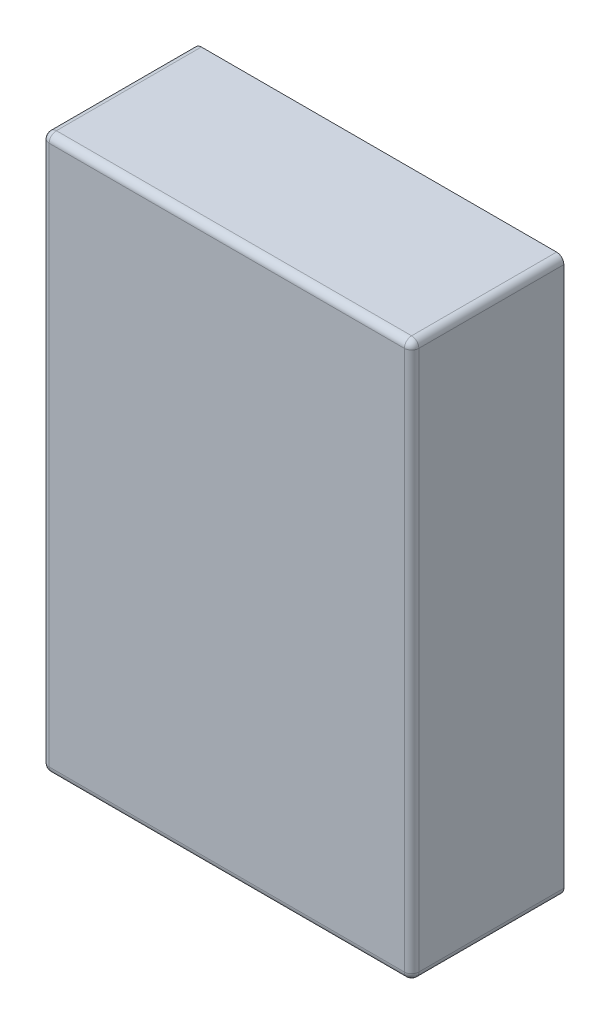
ISO-10303-21;
HEADER;
FILE_DESCRIPTION(('STEP AP214'),'2;1');
FILE_NAME('part.step','',(''),(''),'','','');
FILE_SCHEMA(('AUTOMOTIVE_DESIGN { 1 0 10303 214 1 1 1 1 }'));
ENDSEC;
DATA;
#1=APPLICATION_CONTEXT('core data for automotive mechanical design processes');
#2=APPLICATION_PROTOCOL_DEFINITION('international standard','automotive_design',2000,#1);
#3=PRODUCT_CONTEXT('',#1,'mechanical');
#4=PRODUCT('Part','Part','',(#3));
#5=PRODUCT_RELATED_PRODUCT_CATEGORY('part','',(#4));
#6=PRODUCT_DEFINITION_FORMATION('','',#4);
#7=PRODUCT_DEFINITION_CONTEXT('part definition',#1,'design');
#8=PRODUCT_DEFINITION('design','',#6,#7);
#9=PRODUCT_DEFINITION_SHAPE('','',#8);
#10=(LENGTH_UNIT() NAMED_UNIT(*) SI_UNIT(.MILLI.,.METRE.));
#11=(NAMED_UNIT(*) PLANE_ANGLE_UNIT() SI_UNIT($,.RADIAN.));
#12=(NAMED_UNIT(*) SI_UNIT($,.STERADIAN.) SOLID_ANGLE_UNIT());
#13=UNCERTAINTY_MEASURE_WITH_UNIT(LENGTH_MEASURE(1.E-05),#10,'distance_accuracy_value','');
#14=(GEOMETRIC_REPRESENTATION_CONTEXT(3) GLOBAL_UNCERTAINTY_ASSIGNED_CONTEXT((#13)) GLOBAL_UNIT_ASSIGNED_CONTEXT((#10,
#11,#12)) REPRESENTATION_CONTEXT('',''));
#15=CARTESIAN_POINT('',(0.,0.,0.));
#16=DIRECTION('',(0.,0.,1.));
#17=DIRECTION('',(1.,0.,0.));
#18=AXIS2_PLACEMENT_3D('',#15,#16,#17);
#19=CARTESIAN_POINT('',(9505.591645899,1406.278412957,42.));
#20=DIRECTION('',(0.,0.,1.));
#21=DIRECTION('',(1.,0.,0.));
#22=AXIS2_PLACEMENT_3D('',#19,#20,#21);
#23=PLANE('',#22);
#24=DIRECTION('',(0.,1.,0.));
#25=VECTOR('',#24,1.);
#26=CARTESIAN_POINT('',(9505.59164589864,1480.778412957,42.));
#27=LINE('',#26,#25);
#28=CARTESIAN_POINT('',(9505.59164589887,1555.27841295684,41.9999999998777));
#29=VERTEX_POINT('',#28);
#30=CARTESIAN_POINT('',(9505.59164589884,1406.27841295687,41.9999999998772));
#31=VERTEX_POINT('',#30);
#32=EDGE_CURVE('E403',#29,#31,#27,.F.);
#33=ORIENTED_EDGE('',*,*,#32,.T.);
#34=DIRECTION('',(-1.,0.,0.));
#35=VECTOR('',#34,1.);
#36=CARTESIAN_POINT('',(9554.591645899,1406.27841295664,42.));
#37=LINE('',#36,#35);
#38=CARTESIAN_POINT('',(9603.59164589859,1406.27841295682,42.));
#39=VERTEX_POINT('',#38);
#40=EDGE_CURVE('E290',#31,#39,#37,.F.);
#41=ORIENTED_EDGE('',*,*,#40,.T.);
#42=DIRECTION('',(0.,-1.,0.));
#43=VECTOR('',#42,1.);
#44=CARTESIAN_POINT('',(9603.59164589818,1480.778412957,42.));
#45=LINE('',#44,#43);
#46=CARTESIAN_POINT('',(9603.59164589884,1555.27841295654,41.9999999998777));
#47=VERTEX_POINT('',#46);
#48=EDGE_CURVE('E412',#39,#47,#45,.F.);
#49=ORIENTED_EDGE('',*,*,#48,.T.);
#50=DIRECTION('',(1.,0.,0.));
#51=VECTOR('',#50,1.);
#52=CARTESIAN_POINT('',(9554.591645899,1555.27841295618,42.));
#53=LINE('',#52,#51);
#54=EDGE_CURVE('E334',#47,#29,#53,.F.);
#55=ORIENTED_EDGE('',*,*,#54,.T.);
#56=EDGE_LOOP('',(#33,#41,#49,#55));
#57=FACE_BOUND('',#56,.T.);
#58=ADVANCED_FACE('F17',(#57),#23,.T.);
#59=CARTESIAN_POINT('',(9505.59164589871,1555.2784129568,39.9999999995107));
#60=DIRECTION('',(0.,-1.,0.));
#61=DIRECTION('',(0.,0.,-1.));
#62=AXIS2_PLACEMENT_3D('',#59,#60,#61);
#63=CIRCLE('',#62,0.5);
#64=TRIMMED_CURVE('',#63,(PARAMETER_VALUE(5.71986902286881E-10)),
(PARAMETER_VALUE(3.14159265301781)),.T.,.PARAMETER.);
#65=CARTESIAN_POINT('',(9505.591645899,1555.278412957,40.));
#66=DIRECTION('',(0.,0.,1.));
#67=AXIS1_PLACEMENT('',#65,#66);
#68=SURFACE_OF_REVOLUTION('',#64,#67);
#69=CARTESIAN_POINT('',(9505.591645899,1555.278412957,40.));
#70=DIRECTION('',(1.,0.,0.));
#71=DIRECTION('',(0.,0.,-1.));
#72=AXIS2_PLACEMENT_3D('',#69,#70,#71);
#73=CIRCLE('',#72,0.5);
#74=CARTESIAN_POINT('',(9505.59164589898,1555.2784129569,40.5));
#75=VERTEX_POINT('',#74);
#76=CARTESIAN_POINT('',(9505.591645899,1555.778412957,40.0000000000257));
#77=VERTEX_POINT('',#76);
#78=EDGE_CURVE('E71',#75,#77,#73,.F.);
#79=ORIENTED_EDGE('',*,*,#78,.F.);
#80=CARTESIAN_POINT('',(9505.591645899,1555.278412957,40.));
#81=DIRECTION('',(0.,1.,0.));
#82=DIRECTION('',(0.,0.,1.));
#83=AXIS2_PLACEMENT_3D('',#80,#81,#82);
#84=CIRCLE('',#83,0.5);
#85=CARTESIAN_POINT('',(9505.091645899,1555.278412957,40.));
#86=VERTEX_POINT('',#85);
#87=EDGE_CURVE('E263',#86,#75,#84,.T.);
#88=ORIENTED_EDGE('',*,*,#87,.F.);
#89=CARTESIAN_POINT('',(9505.591645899,1555.278412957,40.));
#90=DIRECTION('',(0.,0.,-1.));
#91=DIRECTION('',(-1.,0.,0.));
#92=AXIS2_PLACEMENT_3D('',#89,#90,#91);
#93=CIRCLE('',#92,0.499999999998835);
#94=EDGE_CURVE('E70',#77,#86,#93,.F.);
#95=ORIENTED_EDGE('',*,*,#94,.F.);
#96=EDGE_LOOP('',(#79,#88,#95));
#97=FACE_BOUND('',#96,.T.);
#98=ADVANCED_FACE('F379',(#97),#68,.F.);
#99=CARTESIAN_POINT('',(9603.59164589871,1555.2784129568,39.9999999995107));
#100=DIRECTION('',(0.,-1.,0.));
#101=DIRECTION('',(0.,0.,-1.));
#102=AXIS2_PLACEMENT_3D('',#99,#100,#101);
#103=CIRCLE('',#102,0.5);
#104=TRIMMED_CURVE('',#103,(PARAMETER_VALUE(5.75539615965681E-10)),
(PARAMETER_VALUE(3.14159265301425)),.T.,.PARAMETER.);
#105=CARTESIAN_POINT('',(9603.591645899,1555.278412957,40.));
#106=DIRECTION('',(0.,0.,1.));
#107=AXIS1_PLACEMENT('',#105,#106);
#108=SURFACE_OF_REVOLUTION('',#104,#107);
#109=CARTESIAN_POINT('',(9603.591645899,1555.278412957,40.));
#110=DIRECTION('',(1.,0.,0.));
#111=DIRECTION('',(0.,0.,-1.));
#112=AXIS2_PLACEMENT_3D('',#109,#110,#111);
#113=CIRCLE('',#112,0.5);
#114=CARTESIAN_POINT('',(9603.59164589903,1555.778412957,40.));
#115=VERTEX_POINT('',#114);
#116=CARTESIAN_POINT('',(9603.5916458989,1555.27841295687,40.5));
#117=VERTEX_POINT('',#116);
#118=EDGE_CURVE('E250',#115,#117,#113,.T.);
#119=ORIENTED_EDGE('',*,*,#118,.F.);
#120=CARTESIAN_POINT('',(9603.591645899,1555.278412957,40.));
#121=DIRECTION('',(0.,0.,-1.));
#122=DIRECTION('',(-1.,0.,0.));
#123=AXIS2_PLACEMENT_3D('',#120,#121,#122);
#124=CIRCLE('',#123,0.500000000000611);
#125=CARTESIAN_POINT('',(9604.091645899,1555.278412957,40.0000000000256));
#126=VERTEX_POINT('',#125);
#127=EDGE_CURVE('E212',#126,#115,#124,.F.);
#128=ORIENTED_EDGE('',*,*,#127,.F.);
#129=CARTESIAN_POINT('',(9603.591645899,1555.278412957,40.));
#130=DIRECTION('',(0.,-1.,0.));
#131=DIRECTION('',(0.,0.,-1.));
#132=AXIS2_PLACEMENT_3D('',#129,#130,#131);
#133=CIRCLE('',#132,0.5);
#134=EDGE_CURVE('E234',#117,#126,#133,.F.);
#135=ORIENTED_EDGE('',*,*,#134,.F.);
#136=EDGE_LOOP('',(#119,#128,#135));
#137=FACE_BOUND('',#136,.T.);
#138=ADVANCED_FACE('F375',(#137),#108,.F.);
#139=CARTESIAN_POINT('',(9505.591645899,1406.278412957,40.5));
#140=DIRECTION('',(0.,0.,1.));
#141=DIRECTION('',(1.,0.,0.));
#142=AXIS2_PLACEMENT_3D('',#139,#140,#141);
#143=PLANE('',#142);
#144=DIRECTION('',(-1.,0.,0.));
#145=VECTOR('',#144,1.);
#146=CARTESIAN_POINT('',(9554.591645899,1406.27841295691,40.5));
#147=LINE('',#146,#145);
#148=CARTESIAN_POINT('',(9505.59164589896,1406.27841295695,40.5));
#149=VERTEX_POINT('',#148);
#150=CARTESIAN_POINT('',(9603.59164589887,1406.27841295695,40.5));
#151=VERTEX_POINT('',#150);
#152=EDGE_CURVE('E211',#149,#151,#147,.F.);
#153=ORIENTED_EDGE('',*,*,#152,.F.);
#154=DIRECTION('',(0.,1.,0.));
#155=VECTOR('',#154,1.);
#156=CARTESIAN_POINT('',(9505.59164589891,1480.778412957,40.5));
#157=LINE('',#156,#155);
#158=EDGE_CURVE('E253',#75,#149,#157,.F.);
#159=ORIENTED_EDGE('',*,*,#158,.F.);
#160=DIRECTION('',(1.,0.,0.));
#161=VECTOR('',#160,1.);
#162=CARTESIAN_POINT('',(9554.591645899,1555.27841295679,40.5));
#163=LINE('',#162,#161);
#164=EDGE_CURVE('E247',#117,#75,#163,.F.);
#165=ORIENTED_EDGE('',*,*,#164,.F.);
#166=DIRECTION('',(0.,-1.,0.));
#167=VECTOR('',#166,1.);
#168=CARTESIAN_POINT('',(9603.5916458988,1480.778412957,40.5));
#169=LINE('',#168,#167);
#170=EDGE_CURVE('E231',#151,#117,#169,.F.);
#171=ORIENTED_EDGE('',*,*,#170,.F.);
#172=EDGE_LOOP('',(#153,#159,#165,#171));
#173=FACE_BOUND('',#172,.T.);
#174=ADVANCED_FACE('F373',(#173),#143,.F.);
#175=CARTESIAN_POINT('',(9603.59164589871,1406.2784129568,39.9999999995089));
#176=DIRECTION('',(0.,-1.,0.));
#177=DIRECTION('',(0.,0.,-1.));
#178=AXIS2_PLACEMENT_3D('',#175,#176,#177);
#179=CIRCLE('',#178,0.5);
#180=TRIMMED_CURVE('',#179,(PARAMETER_VALUE(5.75539615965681E-10)),
(PARAMETER_VALUE(3.14159265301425)),.T.,.PARAMETER.);
#181=CARTESIAN_POINT('',(9603.591645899,1406.278412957,40.));
#182=DIRECTION('',(0.,0.,1.));
#183=AXIS1_PLACEMENT('',#181,#182);
#184=SURFACE_OF_REVOLUTION('',#180,#183);
#185=CARTESIAN_POINT('',(9603.591645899,1406.278412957,40.));
#186=DIRECTION('',(0.,-1.,0.));
#187=DIRECTION('',(0.,0.,-1.));
#188=AXIS2_PLACEMENT_3D('',#185,#186,#187);
#189=CIRCLE('',#188,0.5);
#190=CARTESIAN_POINT('',(9604.091645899,1406.27841295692,40.0000000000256));
#191=VERTEX_POINT('',#190);
#192=EDGE_CURVE('E228',#191,#151,#189,.T.);
#193=ORIENTED_EDGE('',*,*,#192,.F.);
#194=CARTESIAN_POINT('',(9603.591645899,1406.278412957,40.));
#195=DIRECTION('',(0.,0.,-1.));
#196=DIRECTION('',(-1.,0.,0.));
#197=AXIS2_PLACEMENT_3D('',#194,#195,#196);
#198=CIRCLE('',#197,0.500000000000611);
#199=CARTESIAN_POINT('',(9603.591645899,1405.778412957,39.9999999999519));
#200=VERTEX_POINT('',#199);
#201=EDGE_CURVE('E202',#200,#191,#198,.F.);
#202=ORIENTED_EDGE('',*,*,#201,.F.);
#203=CARTESIAN_POINT('',(9603.591645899,1406.278412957,40.));
#204=DIRECTION('',(-1.,0.,0.));
#205=DIRECTION('',(0.,0.,1.));
#206=AXIS2_PLACEMENT_3D('',#203,#204,#205);
#207=CIRCLE('',#206,0.5);
#208=EDGE_CURVE('E215',#151,#200,#207,.F.);
#209=ORIENTED_EDGE('',*,*,#208,.F.);
#210=EDGE_LOOP('',(#193,#202,#209));
#211=FACE_BOUND('',#210,.T.);
#212=ADVANCED_FACE('F370',(#211),#184,.F.);
#213=CARTESIAN_POINT('',(9505.59164589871,1406.2784129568,39.9999999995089));
#214=DIRECTION('',(0.,-1.,0.));
#215=DIRECTION('',(0.,0.,-1.));
#216=AXIS2_PLACEMENT_3D('',#213,#214,#215);
#217=CIRCLE('',#216,0.5);
#218=TRIMMED_CURVE('',#217,(PARAMETER_VALUE(5.71986902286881E-10)),
(PARAMETER_VALUE(3.14159265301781)),.T.,.PARAMETER.);
#219=CARTESIAN_POINT('',(9505.591645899,1406.278412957,40.));
#220=DIRECTION('',(0.,0.,1.));
#221=AXIS1_PLACEMENT('',#219,#220);
#222=SURFACE_OF_REVOLUTION('',#218,#221);
#223=CARTESIAN_POINT('',(9505.591645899,1406.278412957,40.));
#224=DIRECTION('',(0.,1.,0.));
#225=DIRECTION('',(0.,0.,1.));
#226=AXIS2_PLACEMENT_3D('',#223,#224,#225);
#227=CIRCLE('',#226,0.5);
#228=CARTESIAN_POINT('',(9505.091645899,1406.27841295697,39.9999999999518));
#229=VERTEX_POINT('',#228);
#230=EDGE_CURVE('E260',#149,#229,#227,.F.);
#231=ORIENTED_EDGE('',*,*,#230,.F.);
#232=CARTESIAN_POINT('',(9505.591645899,1406.278412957,40.));
#233=DIRECTION('',(-1.,0.,0.));
#234=DIRECTION('',(0.,0.,1.));
#235=AXIS2_PLACEMENT_3D('',#232,#233,#234);
#236=CIRCLE('',#235,0.5);
#237=CARTESIAN_POINT('',(9505.591645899,1405.778412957,39.9999999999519));
#238=VERTEX_POINT('',#237);
#239=EDGE_CURVE('E208',#238,#149,#236,.T.);
#240=ORIENTED_EDGE('',*,*,#239,.F.);
#241=CARTESIAN_POINT('',(9505.591645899,1406.278412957,40.));
#242=DIRECTION('',(0.,0.,-1.));
#243=DIRECTION('',(-1.,0.,0.));
#244=AXIS2_PLACEMENT_3D('',#241,#242,#243);
#245=CIRCLE('',#244,0.499999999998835);
#246=EDGE_CURVE('E193',#229,#238,#245,.F.);
#247=ORIENTED_EDGE('',*,*,#246,.F.);
#248=EDGE_LOOP('',(#231,#240,#247));
#249=FACE_BOUND('',#248,.T.);
#250=ADVANCED_FACE('F357',(#249),#222,.F.);
#251=CARTESIAN_POINT('',(9603.59164589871,1406.2784129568,39.9999999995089));
#252=DIRECTION('',(0.,0.,1.));
#253=DIRECTION('',(-1.,0.,0.));
#254=AXIS2_PLACEMENT_3D('',#251,#252,#253);
#255=SPHERICAL_SURFACE('',#254,2.);
#256=CARTESIAN_POINT('',(9603.591645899,1406.278412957,40.));
#257=DIRECTION('',(0.,0.,-1.));
#258=DIRECTION('',(-1.,0.,0.));
#259=AXIS2_PLACEMENT_3D('',#256,#257,#258);
#260=CIRCLE('',#259,2.00000000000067);
#261=CARTESIAN_POINT('',(9603.591645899,1404.278412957,40.));
#262=VERTEX_POINT('',#261);
#263=CARTESIAN_POINT('',(9605.591645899,1406.27841295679,40.));
#264=VERTEX_POINT('',#263);
#265=EDGE_CURVE('E190',#262,#264,#260,.F.);
#266=ORIENTED_EDGE('',*,*,#265,.T.);
#267=CARTESIAN_POINT('',(9603.591645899,1406.278412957,40.));
#268=DIRECTION('',(0.,-1.,0.));
#269=DIRECTION('',(0.,0.,-1.));
#270=AXIS2_PLACEMENT_3D('',#267,#268,#269);
#271=CIRCLE('',#270,2.);
#272=EDGE_CURVE('E415',#264,#39,#271,.T.);
#273=ORIENTED_EDGE('',*,*,#272,.T.);
#274=CARTESIAN_POINT('',(9603.591645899,1406.278412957,40.));
#275=DIRECTION('',(-1.,0.,0.));
#276=DIRECTION('',(0.,0.,1.));
#277=AXIS2_PLACEMENT_3D('',#274,#275,#276);
#278=CIRCLE('',#277,2.);
#279=EDGE_CURVE('E281',#39,#262,#278,.F.);
#280=ORIENTED_EDGE('',*,*,#279,.T.);
#281=EDGE_LOOP('',(#266,#273,#280));
#282=FACE_BOUND('',#281,.T.);
#283=ADVANCED_FACE('F352',(#282),#255,.T.);
#284=CARTESIAN_POINT('',(9603.591645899,1555.278412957,40.));
#285=DIRECTION('',(0.,-1.,0.));
#286=DIRECTION('',(1.,0.,0.));
#287=AXIS2_PLACEMENT_3D('',#284,#285,#286);
#288=CYLINDRICAL_SURFACE('',#287,2.);
#289=DIRECTION('',(0.,1.,0.));
#290=VECTOR('',#289,1.);
#291=CARTESIAN_POINT('',(9605.591645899,1480.778412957,40.));
#292=LINE('',#291,#290);
#293=CARTESIAN_POINT('',(9605.59164589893,1555.27841295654,40.));
#294=VERTEX_POINT('',#293);
#295=EDGE_CURVE('E184',#264,#294,#292,.T.);
#296=ORIENTED_EDGE('',*,*,#295,.T.);
#297=CARTESIAN_POINT('',(9603.59164589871,1555.2784129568,39.9999999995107));
#298=DIRECTION('',(0.,-1.,0.));
#299=DIRECTION('',(8.88178419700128E-13,0.,-1.));
#300=AXIS2_PLACEMENT_3D('',#297,#298,#299);
#301=CIRCLE('',#300,2.);
#302=EDGE_CURVE('E343',#294,#47,#301,.T.);
#303=ORIENTED_EDGE('',*,*,#302,.T.);
#304=ORIENTED_EDGE('',*,*,#48,.F.);
#305=ORIENTED_EDGE('',*,*,#272,.F.);
#306=EDGE_LOOP('',(#296,#303,#304,#305));
#307=FACE_BOUND('',#306,.T.);
#308=ADVANCED_FACE('F348',(#307),#288,.T.);
#309=CARTESIAN_POINT('',(9603.59164589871,1555.2784129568,39.9999999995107));
#310=DIRECTION('',(0.,0.,1.));
#311=DIRECTION('',(-1.,0.,0.));
#312=AXIS2_PLACEMENT_3D('',#309,#310,#311);
#313=SPHERICAL_SURFACE('',#312,2.);
#314=CARTESIAN_POINT('',(9603.591645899,1555.278412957,40.));
#315=DIRECTION('',(0.,0.,-1.));
#316=DIRECTION('',(-1.,0.,0.));
#317=AXIS2_PLACEMENT_3D('',#314,#315,#316);
#318=CIRCLE('',#317,2.00000000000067);
#319=CARTESIAN_POINT('',(9603.59164589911,1557.278412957,40.));
#320=VERTEX_POINT('',#319);
#321=EDGE_CURVE('E178',#294,#320,#318,.F.);
#322=ORIENTED_EDGE('',*,*,#321,.T.);
#323=CARTESIAN_POINT('',(9603.591645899,1555.278412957,40.));
#324=DIRECTION('',(1.,0.,0.));
#325=DIRECTION('',(0.,0.,-1.));
#326=AXIS2_PLACEMENT_3D('',#323,#324,#325);
#327=CIRCLE('',#326,2.);
#328=EDGE_CURVE('E325',#320,#47,#327,.T.);
#329=ORIENTED_EDGE('',*,*,#328,.T.);
#330=ORIENTED_EDGE('',*,*,#302,.F.);
#331=EDGE_LOOP('',(#322,#329,#330));
#332=FACE_BOUND('',#331,.T.);
#333=ADVANCED_FACE('F345',(#332),#313,.T.);
#334=CARTESIAN_POINT('',(9505.591645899,1555.278412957,40.));
#335=DIRECTION('',(1.,4.44089209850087E-13,0.));
#336=DIRECTION('',(-4.44089209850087E-13,1.,0.));
#337=AXIS2_PLACEMENT_3D('',#334,#335,#336);
#338=CYLINDRICAL_SURFACE('',#337,2.);
#339=DIRECTION('',(-1.,0.,0.));
#340=VECTOR('',#339,1.);
#341=CARTESIAN_POINT('',(9554.591645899,1557.278412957,40.));
#342=LINE('',#341,#340);
#343=CARTESIAN_POINT('',(9505.59164589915,1557.27841295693,40.));
#344=VERTEX_POINT('',#343);
#345=EDGE_CURVE('E172',#320,#344,#342,.T.);
#346=ORIENTED_EDGE('',*,*,#345,.T.);
#347=CARTESIAN_POINT('',(9505.5916458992,1555.27841295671,39.9999999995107));
#348=DIRECTION('',(1.,2.05103206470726E-10,0.));
#349=DIRECTION('',(0.,0.,-1.));
#350=AXIS2_PLACEMENT_3D('',#347,#348,#349);
#351=CIRCLE('',#350,2.);
#352=EDGE_CURVE('E321',#344,#29,#351,.T.);
#353=ORIENTED_EDGE('',*,*,#352,.T.);
#354=ORIENTED_EDGE('',*,*,#54,.F.);
#355=ORIENTED_EDGE('',*,*,#328,.F.);
#356=EDGE_LOOP('',(#346,#353,#354,#355));
#357=FACE_BOUND('',#356,.T.);
#358=ADVANCED_FACE('F313',(#357),#338,.T.);
#359=CARTESIAN_POINT('',(9505.59164589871,1555.2784129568,39.9999999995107));
#360=DIRECTION('',(0.,0.,1.));
#361=DIRECTION('',(-1.,0.,0.));
#362=AXIS2_PLACEMENT_3D('',#359,#360,#361);
#363=SPHERICAL_SURFACE('',#362,2.);
#364=CARTESIAN_POINT('',(9505.591645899,1555.278412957,40.));
#365=DIRECTION('',(0.,1.,0.));
#366=DIRECTION('',(0.,0.,1.));
#367=AXIS2_PLACEMENT_3D('',#364,#365,#366);
#368=CIRCLE('',#367,2.);
#369=CARTESIAN_POINT('',(9503.591645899,1555.278412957,40.));
#370=VERTEX_POINT('',#369);
#371=EDGE_CURVE('E324',#370,#29,#368,.T.);
#372=ORIENTED_EDGE('',*,*,#371,.T.);
#373=ORIENTED_EDGE('',*,*,#352,.F.);
#374=CARTESIAN_POINT('',(9505.591645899,1555.278412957,40.));
#375=DIRECTION('',(0.,0.,-1.));
#376=DIRECTION('',(-1.,0.,0.));
#377=AXIS2_PLACEMENT_3D('',#374,#375,#376);
#378=CIRCLE('',#377,1.99999999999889);
#379=EDGE_CURVE('E166',#344,#370,#378,.F.);
#380=ORIENTED_EDGE('',*,*,#379,.T.);
#381=EDGE_LOOP('',(#372,#373,#380));
#382=FACE_BOUND('',#381,.T.);
#383=ADVANCED_FACE('F308',(#382),#363,.T.);
#384=CARTESIAN_POINT('',(9505.591645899,1406.278412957,40.));
#385=DIRECTION('',(0.,1.,0.));
#386=DIRECTION('',(0.,0.,1.));
#387=AXIS2_PLACEMENT_3D('',#384,#385,#386);
#388=CYLINDRICAL_SURFACE('',#387,2.);
#389=ORIENTED_EDGE('',*,*,#32,.F.);
#390=ORIENTED_EDGE('',*,*,#371,.F.);
#391=DIRECTION('',(0.,-1.,0.));
#392=VECTOR('',#391,1.);
#393=CARTESIAN_POINT('',(9503.591645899,1480.778412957,40.));
#394=LINE('',#393,#392);
#395=CARTESIAN_POINT('',(9503.59164589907,1406.27841295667,40.));
#396=VERTEX_POINT('',#395);
#397=EDGE_CURVE('E160',#370,#396,#394,.T.);
#398=ORIENTED_EDGE('',*,*,#397,.T.);
#399=CARTESIAN_POINT('',(9505.59164589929,1406.2784129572,39.9999999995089));
#400=DIRECTION('',(-4.10206857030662E-10,1.,0.));
#401=DIRECTION('',(0.,0.,-1.));
#402=AXIS2_PLACEMENT_3D('',#399,#400,#401);
#403=CIRCLE('',#402,2.);
#404=EDGE_CURVE('E295',#396,#31,#403,.T.);
#405=ORIENTED_EDGE('',*,*,#404,.T.);
#406=EDGE_LOOP('',(#389,#390,#398,#405));
#407=FACE_BOUND('',#406,.T.);
#408=ADVANCED_FACE('F303',(#407),#388,.T.);
#409=CARTESIAN_POINT('',(9505.59164589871,1406.2784129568,39.9999999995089));
#410=DIRECTION('',(0.,0.,1.));
#411=DIRECTION('',(-1.,0.,0.));
#412=AXIS2_PLACEMENT_3D('',#409,#410,#411);
#413=SPHERICAL_SURFACE('',#412,2.);
#414=CARTESIAN_POINT('',(9505.591645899,1406.278412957,40.));
#415=DIRECTION('',(-1.,0.,0.));
#416=DIRECTION('',(0.,0.,1.));
#417=AXIS2_PLACEMENT_3D('',#414,#415,#416);
#418=CIRCLE('',#417,2.);
#419=CARTESIAN_POINT('',(9505.591645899,1404.278412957,40.));
#420=VERTEX_POINT('',#419);
#421=EDGE_CURVE('E264',#420,#31,#418,.T.);
#422=ORIENTED_EDGE('',*,*,#421,.T.);
#423=ORIENTED_EDGE('',*,*,#404,.F.);
#424=CARTESIAN_POINT('',(9505.591645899,1406.278412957,40.));
#425=DIRECTION('',(0.,0.,-1.));
#426=DIRECTION('',(-1.,0.,0.));
#427=AXIS2_PLACEMENT_3D('',#424,#425,#426);
#428=CIRCLE('',#427,1.99999999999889);
#429=EDGE_CURVE('E154',#396,#420,#428,.F.);
#430=ORIENTED_EDGE('',*,*,#429,.T.);
#431=EDGE_LOOP('',(#422,#423,#430));
#432=FACE_BOUND('',#431,.T.);
#433=ADVANCED_FACE('F298',(#432),#413,.T.);
#434=CARTESIAN_POINT('',(9603.591645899,1406.278412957,40.));
#435=DIRECTION('',(-1.,0.,0.));
#436=DIRECTION('',(0.,0.,1.));
#437=AXIS2_PLACEMENT_3D('',#434,#435,#436);
#438=CYLINDRICAL_SURFACE('',#437,2.);
#439=DIRECTION('',(1.,0.,0.));
#440=VECTOR('',#439,1.);
#441=CARTESIAN_POINT('',(9554.591645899,1404.278412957,40.));
#442=LINE('',#441,#440);
#443=EDGE_CURVE('E143',#420,#262,#442,.T.);
#444=ORIENTED_EDGE('',*,*,#443,.T.);
#445=ORIENTED_EDGE('',*,*,#279,.F.);
#446=ORIENTED_EDGE('',*,*,#40,.F.);
#447=ORIENTED_EDGE('',*,*,#421,.F.);
#448=EDGE_LOOP('',(#444,#445,#446,#447));
#449=FACE_BOUND('',#448,.T.);
#450=ADVANCED_FACE('F302',(#449),#438,.T.);
#451=CARTESIAN_POINT('',(9505.591645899,1406.278412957,40.));
#452=DIRECTION('',(0.,1.,0.));
#453=DIRECTION('',(0.,0.,1.));
#454=AXIS2_PLACEMENT_3D('',#451,#452,#453);
#455=CYLINDRICAL_SURFACE('',#454,0.5);
#456=ORIENTED_EDGE('',*,*,#87,.T.);
#457=ORIENTED_EDGE('',*,*,#158,.T.);
#458=ORIENTED_EDGE('',*,*,#230,.T.);
#459=DIRECTION('',(0.,-1.,0.));
#460=VECTOR('',#459,1.);
#461=CARTESIAN_POINT('',(9505.091645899,1480.778412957,40.));
#462=LINE('',#461,#460);
#463=EDGE_CURVE('E139',#86,#229,#462,.T.);
#464=ORIENTED_EDGE('',*,*,#463,.F.);
#465=EDGE_LOOP('',(#456,#457,#458,#464));
#466=FACE_BOUND('',#465,.T.);
#467=ADVANCED_FACE('F657',(#466),#455,.F.);
#468=CARTESIAN_POINT('',(9505.591645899,1555.278412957,40.));
#469=DIRECTION('',(1.,1.77635683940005E-12,0.));
#470=DIRECTION('',(-1.77635683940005E-12,1.,0.));
#471=AXIS2_PLACEMENT_3D('',#468,#469,#470);
#472=CYLINDRICAL_SURFACE('',#471,0.5);
#473=ORIENTED_EDGE('',*,*,#78,.T.);
#474=DIRECTION('',(-1.,0.,0.));
#475=VECTOR('',#474,1.);
#476=CARTESIAN_POINT('',(9554.591645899,1555.778412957,40.));
#477=LINE('',#476,#475);
#478=EDGE_CURVE('E79',#115,#77,#477,.T.);
#479=ORIENTED_EDGE('',*,*,#478,.F.);
#480=ORIENTED_EDGE('',*,*,#118,.T.);
#481=ORIENTED_EDGE('',*,*,#164,.T.);
#482=EDGE_LOOP('',(#473,#479,#480,#481));
#483=FACE_BOUND('',#482,.T.);
#484=ADVANCED_FACE('F663',(#483),#472,.F.);
#485=CARTESIAN_POINT('',(9505.591645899,1555.278412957,40.));
#486=DIRECTION('',(0.,0.,-1.));
#487=DIRECTION('',(0.,1.,0.));
#488=AXIS2_PLACEMENT_3D('',#485,#486,#487);
#489=CYLINDRICAL_SURFACE('',#488,0.499999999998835);
#490=ORIENTED_EDGE('',*,*,#94,.T.);
#491=DIRECTION('',(0.,0.,1.));
#492=VECTOR('',#491,1.);
#493=CARTESIAN_POINT('',(9505.091645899,1555.278412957,20.));
#494=LINE('',#493,#492);
#495=CARTESIAN_POINT('',(9505.091645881,1555.278412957,0.));
#496=VERTEX_POINT('',#495);
#497=EDGE_CURVE('E68',#496,#86,#494,.T.);
#498=ORIENTED_EDGE('',*,*,#497,.F.);
#499=CARTESIAN_POINT('',(9505.591645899,1555.278412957,0.));
#500=DIRECTION('',(0.,0.,-1.));
#501=DIRECTION('',(0.,1.,0.));
#502=AXIS2_PLACEMENT_3D('',#499,#500,#501);
#503=CIRCLE('',#502,0.499999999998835);
#504=CARTESIAN_POINT('',(9505.591645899,1555.778412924,0.));
#505=VERTEX_POINT('',#504);
#506=EDGE_CURVE('E21',#496,#505,#503,.T.);
#507=ORIENTED_EDGE('',*,*,#506,.T.);
#508=DIRECTION('',(0.,0.,-1.));
#509=VECTOR('',#508,1.);
#510=CARTESIAN_POINT('',(9505.591645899,1555.778412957,20.));
#511=LINE('',#510,#509);
#512=EDGE_CURVE('E66',#77,#505,#511,.T.);
#513=ORIENTED_EDGE('',*,*,#512,.F.);
#514=EDGE_LOOP('',(#490,#498,#507,#513));
#515=FACE_BOUND('',#514,.T.);
#516=ADVANCED_FACE('F64',(#515),#489,.F.);
#517=CARTESIAN_POINT('',(9603.591645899,1555.278412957,40.));
#518=DIRECTION('',(-2.22044604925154E-13,-1.,0.));
#519=DIRECTION('',(1.,-2.22044604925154E-13,0.));
#520=AXIS2_PLACEMENT_3D('',#517,#518,#519);
#521=CYLINDRICAL_SURFACE('',#520,0.5);
#522=ORIENTED_EDGE('',*,*,#134,.T.);
#523=DIRECTION('',(0.,1.,0.));
#524=VECTOR('',#523,1.);
#525=CARTESIAN_POINT('',(9604.091645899,1480.778412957,40.));
#526=LINE('',#525,#524);
#527=EDGE_CURVE('E81',#191,#126,#526,.T.);
#528=ORIENTED_EDGE('',*,*,#527,.F.);
#529=ORIENTED_EDGE('',*,*,#192,.T.);
#530=ORIENTED_EDGE('',*,*,#170,.T.);
#531=EDGE_LOOP('',(#522,#528,#529,#530));
#532=FACE_BOUND('',#531,.T.);
#533=ADVANCED_FACE('F444',(#532),#521,.F.);
#534=CARTESIAN_POINT('',(9603.591645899,1555.278412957,40.));
#535=DIRECTION('',(0.,0.,-1.));
#536=DIRECTION('',(0.,1.,0.));
#537=AXIS2_PLACEMENT_3D('',#534,#535,#536);
#538=CYLINDRICAL_SURFACE('',#537,0.500000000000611);
#539=ORIENTED_EDGE('',*,*,#127,.T.);
#540=DIRECTION('',(0.,0.,1.));
#541=VECTOR('',#540,1.);
#542=CARTESIAN_POINT('',(9603.591645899,1555.778412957,20.));
#543=LINE('',#542,#541);
#544=CARTESIAN_POINT('',(9603.591645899,1555.778412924,0.));
#545=VERTEX_POINT('',#544);
#546=EDGE_CURVE('E132',#545,#115,#543,.T.);
#547=ORIENTED_EDGE('',*,*,#546,.F.);
#548=CARTESIAN_POINT('',(9603.591645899,1555.278412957,0.));
#549=DIRECTION('',(0.,0.,-1.));
#550=DIRECTION('',(0.,1.,0.));
#551=AXIS2_PLACEMENT_3D('',#548,#549,#550);
#552=CIRCLE('',#551,0.500000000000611);
#553=CARTESIAN_POINT('',(9604.091645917,1555.278412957,0.));
#554=VERTEX_POINT('',#553);
#555=EDGE_CURVE('E85',#545,#554,#552,.T.);
#556=ORIENTED_EDGE('',*,*,#555,.T.);
#557=DIRECTION('',(0.,0.,-1.));
#558=VECTOR('',#557,1.);
#559=CARTESIAN_POINT('',(9604.091645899,1555.278412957,20.));
#560=LINE('',#559,#558);
#561=EDGE_CURVE('E120',#126,#554,#560,.T.);
#562=ORIENTED_EDGE('',*,*,#561,.F.);
#563=EDGE_LOOP('',(#539,#547,#556,#562));
#564=FACE_BOUND('',#563,.T.);
#565=ADVANCED_FACE('F429',(#564),#538,.F.);
#566=CARTESIAN_POINT('',(9603.591645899,1406.278412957,40.));
#567=DIRECTION('',(-1.,0.,0.));
#568=DIRECTION('',(0.,0.,1.));
#569=AXIS2_PLACEMENT_3D('',#566,#567,#568);
#570=CYLINDRICAL_SURFACE('',#569,0.5);
#571=ORIENTED_EDGE('',*,*,#208,.T.);
#572=DIRECTION('',(1.,0.,0.));
#573=VECTOR('',#572,1.);
#574=CARTESIAN_POINT('',(9554.591645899,1405.778412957,40.));
#575=LINE('',#574,#573);
#576=EDGE_CURVE('E113',#238,#200,#575,.T.);
#577=ORIENTED_EDGE('',*,*,#576,.F.);
#578=ORIENTED_EDGE('',*,*,#239,.T.);
#579=ORIENTED_EDGE('',*,*,#152,.T.);
#580=EDGE_LOOP('',(#571,#577,#578,#579));
#581=FACE_BOUND('',#580,.T.);
#582=ADVANCED_FACE('F538',(#581),#570,.F.);
#583=CARTESIAN_POINT('',(9603.591645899,1406.278412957,40.));
#584=DIRECTION('',(0.,0.,-1.));
#585=DIRECTION('',(0.,1.,0.));
#586=AXIS2_PLACEMENT_3D('',#583,#584,#585);
#587=CYLINDRICAL_SURFACE('',#586,0.500000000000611);
#588=ORIENTED_EDGE('',*,*,#201,.T.);
#589=DIRECTION('',(0.,0.,1.));
#590=VECTOR('',#589,1.);
#591=CARTESIAN_POINT('',(9604.091645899,1406.278412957,20.));
#592=LINE('',#591,#590);
#593=CARTESIAN_POINT('',(9604.091645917,1406.278412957,0.));
#594=VERTEX_POINT('',#593);
#595=EDGE_CURVE('E123',#594,#191,#592,.T.);
#596=ORIENTED_EDGE('',*,*,#595,.F.);
#597=CARTESIAN_POINT('',(9603.591645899,1406.278412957,0.));
#598=DIRECTION('',(0.,0.,-1.));
#599=DIRECTION('',(0.,1.,0.));
#600=AXIS2_PLACEMENT_3D('',#597,#598,#599);
#601=CIRCLE('',#600,0.500000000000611);
#602=CARTESIAN_POINT('',(9603.591645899,1405.77841299,0.));
#603=VERTEX_POINT('',#602);
#604=EDGE_CURVE('E205',#594,#603,#601,.T.);
#605=ORIENTED_EDGE('',*,*,#604,.T.);
#606=DIRECTION('',(0.,0.,-1.));
#607=VECTOR('',#606,1.);
#608=CARTESIAN_POINT('',(9603.591645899,1405.778412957,20.));
#609=LINE('',#608,#607);
#610=EDGE_CURVE('E109',#200,#603,#609,.T.);
#611=ORIENTED_EDGE('',*,*,#610,.F.);
#612=EDGE_LOOP('',(#588,#596,#605,#611));
#613=FACE_BOUND('',#612,.T.);
#614=ADVANCED_FACE('F438',(#613),#587,.F.);
#615=CARTESIAN_POINT('',(9505.591645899,1406.278412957,40.));
#616=DIRECTION('',(0.,0.,-1.));
#617=DIRECTION('',(0.,1.,0.));
#618=AXIS2_PLACEMENT_3D('',#615,#616,#617);
#619=CYLINDRICAL_SURFACE('',#618,0.499999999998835);
#620=ORIENTED_EDGE('',*,*,#246,.T.);
#621=DIRECTION('',(0.,0.,1.));
#622=VECTOR('',#621,1.);
#623=CARTESIAN_POINT('',(9505.591645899,1405.778412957,20.));
#624=LINE('',#623,#622);
#625=CARTESIAN_POINT('',(9505.591645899,1405.77841299,0.));
#626=VERTEX_POINT('',#625);
#627=EDGE_CURVE('E112',#626,#238,#624,.T.);
#628=ORIENTED_EDGE('',*,*,#627,.F.);
#629=CARTESIAN_POINT('',(9505.591645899,1406.278412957,0.));
#630=DIRECTION('',(0.,0.,-1.));
#631=DIRECTION('',(0.,1.,0.));
#632=AXIS2_PLACEMENT_3D('',#629,#630,#631);
#633=CIRCLE('',#632,0.499999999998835);
#634=CARTESIAN_POINT('',(9505.091645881,1406.278412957,0.));
#635=VERTEX_POINT('',#634);
#636=EDGE_CURVE('E36',#626,#635,#633,.T.);
#637=ORIENTED_EDGE('',*,*,#636,.T.);
#638=DIRECTION('',(0.,0.,-1.));
#639=VECTOR('',#638,1.);
#640=CARTESIAN_POINT('',(9505.091645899,1406.278412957,20.));
#641=LINE('',#640,#639);
#642=EDGE_CURVE('E134',#229,#635,#641,.T.);
#643=ORIENTED_EDGE('',*,*,#642,.F.);
#644=EDGE_LOOP('',(#620,#628,#637,#643));
#645=FACE_BOUND('',#644,.T.);
#646=ADVANCED_FACE('F533',(#645),#619,.F.);
#647=CARTESIAN_POINT('',(9603.591645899,1406.278412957,40.));
#648=DIRECTION('',(0.,0.,-1.));
#649=DIRECTION('',(0.,1.,0.));
#650=AXIS2_PLACEMENT_3D('',#647,#648,#649);
#651=CYLINDRICAL_SURFACE('',#650,2.00000000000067);
#652=DIRECTION('',(0.,0.,1.));
#653=VECTOR('',#652,1.);
#654=CARTESIAN_POINT('',(9605.591645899,1406.278412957,20.));
#655=LINE('',#654,#653);
#656=CARTESIAN_POINT('',(9605.591645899,1406.278412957,0.));
#657=VERTEX_POINT('',#656);
#658=EDGE_CURVE('E187',#657,#264,#655,.T.);
#659=ORIENTED_EDGE('',*,*,#658,.T.);
#660=ORIENTED_EDGE('',*,*,#265,.F.);
#661=DIRECTION('',(0.,0.,-1.));
#662=VECTOR('',#661,1.);
#663=CARTESIAN_POINT('',(9603.591645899,1404.278412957,20.));
#664=LINE('',#663,#662);
#665=CARTESIAN_POINT('',(9603.591645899,1404.278412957,0.));
#666=VERTEX_POINT('',#665);
#667=EDGE_CURVE('E149',#262,#666,#664,.T.);
#668=ORIENTED_EDGE('',*,*,#667,.T.);
#669=CARTESIAN_POINT('',(9603.591645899,1406.278412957,0.));
#670=DIRECTION('',(0.,0.,-1.));
#671=DIRECTION('',(0.,1.,0.));
#672=AXIS2_PLACEMENT_3D('',#669,#670,#671);
#673=CIRCLE('',#672,2.00000000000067);
#674=EDGE_CURVE('E108',#666,#657,#673,.F.);
#675=ORIENTED_EDGE('',*,*,#674,.T.);
#676=EDGE_LOOP('',(#659,#660,#668,#675));
#677=FACE_BOUND('',#676,.T.);
#678=ADVANCED_FACE('F581',(#677),#651,.T.);
#679=CARTESIAN_POINT('',(9605.591645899,1406.278412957,0.));
#680=DIRECTION('',(-1.,0.,0.));
#681=DIRECTION('',(0.,0.,1.));
#682=AXIS2_PLACEMENT_3D('',#679,#680,#681);
#683=PLANE('',#682);
#684=ORIENTED_EDGE('',*,*,#658,.F.);
#685=DIRECTION('',(0.,1.,0.));
#686=VECTOR('',#685,1.);
#687=CARTESIAN_POINT('',(9605.591645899,1480.778412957,0.));
#688=LINE('',#687,#686);
#689=CARTESIAN_POINT('',(9605.591645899,1555.27841295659,0.));
#690=VERTEX_POINT('',#689);
#691=EDGE_CURVE('E105',#657,#690,#688,.T.);
#692=ORIENTED_EDGE('',*,*,#691,.T.);
#693=DIRECTION('',(0.,0.,-1.));
#694=VECTOR('',#693,1.);
#695=CARTESIAN_POINT('',(9605.591645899,1555.27841295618,20.));
#696=LINE('',#695,#694);
#697=EDGE_CURVE('E181',#690,#294,#696,.F.);
#698=ORIENTED_EDGE('',*,*,#697,.T.);
#699=ORIENTED_EDGE('',*,*,#295,.F.);
#700=EDGE_LOOP('',(#684,#692,#698,#699));
#701=FACE_BOUND('',#700,.T.);
#702=ADVANCED_FACE('F578',(#701),#683,.F.);
#703=CARTESIAN_POINT('',(9603.591645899,1555.278412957,40.));
#704=DIRECTION('',(0.,0.,-1.));
#705=DIRECTION('',(0.,1.,0.));
#706=AXIS2_PLACEMENT_3D('',#703,#704,#705);
#707=CYLINDRICAL_SURFACE('',#706,2.00000000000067);
#708=DIRECTION('',(0.,0.,1.));
#709=VECTOR('',#708,1.);
#710=CARTESIAN_POINT('',(9603.591645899,1557.278412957,20.));
#711=LINE('',#710,#709);
#712=CARTESIAN_POINT('',(9603.591645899,1557.278412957,0.));
#713=VERTEX_POINT('',#712);
#714=EDGE_CURVE('E175',#713,#320,#711,.T.);
#715=ORIENTED_EDGE('',*,*,#714,.T.);
#716=ORIENTED_EDGE('',*,*,#321,.F.);
#717=ORIENTED_EDGE('',*,*,#697,.F.);
#718=CARTESIAN_POINT('',(9603.591645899,1555.278412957,0.));
#719=DIRECTION('',(0.,0.,-1.));
#720=DIRECTION('',(0.,1.,0.));
#721=AXIS2_PLACEMENT_3D('',#718,#719,#720);
#722=CIRCLE('',#721,2.00000000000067);
#723=EDGE_CURVE('E104',#690,#713,#722,.F.);
#724=ORIENTED_EDGE('',*,*,#723,.T.);
#725=EDGE_LOOP('',(#715,#716,#717,#724));
#726=FACE_BOUND('',#725,.T.);
#727=ADVANCED_FACE('F576',(#726),#707,.T.);
#728=CARTESIAN_POINT('',(9505.591645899,1557.278412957,40.));
#729=DIRECTION('',(0.,-1.,0.));
#730=DIRECTION('',(0.,0.,-1.));
#731=AXIS2_PLACEMENT_3D('',#728,#729,#730);
#732=PLANE('',#731);
#733=DIRECTION('',(0.,0.,-1.));
#734=VECTOR('',#733,1.);
#735=CARTESIAN_POINT('',(9505.59164589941,1557.278412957,20.));
#736=LINE('',#735,#734);
#737=CARTESIAN_POINT('',(9505.59164589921,1557.278412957,0.));
#738=VERTEX_POINT('',#737);
#739=EDGE_CURVE('E169',#738,#344,#736,.F.);
#740=ORIENTED_EDGE('',*,*,#739,.T.);
#741=ORIENTED_EDGE('',*,*,#345,.F.);
#742=ORIENTED_EDGE('',*,*,#714,.F.);
#743=DIRECTION('',(-1.,0.,0.));
#744=VECTOR('',#743,1.);
#745=CARTESIAN_POINT('',(9554.591645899,1557.278412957,0.));
#746=LINE('',#745,#744);
#747=EDGE_CURVE('E101',#713,#738,#746,.T.);
#748=ORIENTED_EDGE('',*,*,#747,.T.);
#749=EDGE_LOOP('',(#740,#741,#742,#748));
#750=FACE_BOUND('',#749,.T.);
#751=ADVANCED_FACE('F573',(#750),#732,.F.);
#752=CARTESIAN_POINT('',(9505.591645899,1555.278412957,40.));
#753=DIRECTION('',(0.,0.,-1.));
#754=DIRECTION('',(0.,1.,0.));
#755=AXIS2_PLACEMENT_3D('',#752,#753,#754);
#756=CYLINDRICAL_SURFACE('',#755,1.99999999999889);
#757=DIRECTION('',(0.,0.,1.));
#758=VECTOR('',#757,1.);
#759=CARTESIAN_POINT('',(9503.591645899,1555.278412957,20.));
#760=LINE('',#759,#758);
#761=CARTESIAN_POINT('',(9503.591645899,1555.278412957,0.));
#762=VERTEX_POINT('',#761);
#763=EDGE_CURVE('E163',#762,#370,#760,.T.);
#764=ORIENTED_EDGE('',*,*,#763,.T.);
#765=ORIENTED_EDGE('',*,*,#379,.F.);
#766=ORIENTED_EDGE('',*,*,#739,.F.);
#767=CARTESIAN_POINT('',(9505.591645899,1555.278412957,0.));
#768=DIRECTION('',(0.,0.,-1.));
#769=DIRECTION('',(0.,1.,0.));
#770=AXIS2_PLACEMENT_3D('',#767,#768,#769);
#771=CIRCLE('',#770,1.99999999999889);
#772=EDGE_CURVE('E100',#738,#762,#771,.F.);
#773=ORIENTED_EDGE('',*,*,#772,.T.);
#774=EDGE_LOOP('',(#764,#765,#766,#773));
#775=FACE_BOUND('',#774,.T.);
#776=ADVANCED_FACE('F571',(#775),#756,.T.);
#777=CARTESIAN_POINT('',(9503.591645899,1406.278412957,40.));
#778=DIRECTION('',(1.,0.,0.));
#779=DIRECTION('',(0.,0.,-1.));
#780=AXIS2_PLACEMENT_3D('',#777,#778,#779);
#781=PLANE('',#780);
#782=DIRECTION('',(0.,0.,-1.));
#783=VECTOR('',#782,1.);
#784=CARTESIAN_POINT('',(9503.591645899,1406.27841295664,20.));
#785=LINE('',#784,#783);
#786=CARTESIAN_POINT('',(9503.591645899,1406.27841295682,0.));
#787=VERTEX_POINT('',#786);
#788=EDGE_CURVE('E157',#787,#396,#785,.F.);
#789=ORIENTED_EDGE('',*,*,#788,.T.);
#790=ORIENTED_EDGE('',*,*,#397,.F.);
#791=ORIENTED_EDGE('',*,*,#763,.F.);
#792=DIRECTION('',(0.,-1.,0.));
#793=VECTOR('',#792,1.);
#794=CARTESIAN_POINT('',(9503.591645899,1480.778412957,0.));
#795=LINE('',#794,#793);
#796=EDGE_CURVE('E97',#762,#787,#795,.T.);
#797=ORIENTED_EDGE('',*,*,#796,.T.);
#798=EDGE_LOOP('',(#789,#790,#791,#797));
#799=FACE_BOUND('',#798,.T.);
#800=ADVANCED_FACE('F568',(#799),#781,.F.);
#801=CARTESIAN_POINT('',(9505.591645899,1406.278412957,40.));
#802=DIRECTION('',(0.,0.,-1.));
#803=DIRECTION('',(0.,1.,0.));
#804=AXIS2_PLACEMENT_3D('',#801,#802,#803);
#805=CYLINDRICAL_SURFACE('',#804,1.99999999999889);
#806=DIRECTION('',(0.,0.,1.));
#807=VECTOR('',#806,1.);
#808=CARTESIAN_POINT('',(9505.591645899,1404.278412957,20.));
#809=LINE('',#808,#807);
#810=CARTESIAN_POINT('',(9505.591645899,1404.278412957,0.));
#811=VERTEX_POINT('',#810);
#812=EDGE_CURVE('E146',#811,#420,#809,.T.);
#813=ORIENTED_EDGE('',*,*,#812,.T.);
#814=ORIENTED_EDGE('',*,*,#429,.F.);
#815=ORIENTED_EDGE('',*,*,#788,.F.);
#816=CARTESIAN_POINT('',(9505.591645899,1406.278412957,0.));
#817=DIRECTION('',(0.,0.,-1.));
#818=DIRECTION('',(0.,1.,0.));
#819=AXIS2_PLACEMENT_3D('',#816,#817,#818);
#820=CIRCLE('',#819,1.99999999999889);
#821=EDGE_CURVE('E96',#787,#811,#820,.F.);
#822=ORIENTED_EDGE('',*,*,#821,.T.);
#823=EDGE_LOOP('',(#813,#814,#815,#822));
#824=FACE_BOUND('',#823,.T.);
#825=ADVANCED_FACE('F566',(#824),#805,.T.);
#826=CARTESIAN_POINT('',(9505.591645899,1404.278412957,0.));
#827=DIRECTION('',(0.,1.,0.));
#828=DIRECTION('',(0.,0.,1.));
#829=AXIS2_PLACEMENT_3D('',#826,#827,#828);
#830=PLANE('',#829);
#831=ORIENTED_EDGE('',*,*,#812,.F.);
#832=DIRECTION('',(1.,0.,0.));
#833=VECTOR('',#832,1.);
#834=CARTESIAN_POINT('',(9554.591645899,1404.278412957,0.));
#835=LINE('',#834,#833);
#836=EDGE_CURVE('E91',#811,#666,#835,.T.);
#837=ORIENTED_EDGE('',*,*,#836,.T.);
#838=ORIENTED_EDGE('',*,*,#667,.F.);
#839=ORIENTED_EDGE('',*,*,#443,.F.);
#840=EDGE_LOOP('',(#831,#837,#838,#839));
#841=FACE_BOUND('',#840,.T.);
#842=ADVANCED_FACE('F562',(#841),#830,.F.);
#843=CARTESIAN_POINT('',(9505.091645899,1406.278412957,40.));
#844=DIRECTION('',(1.,0.,0.));
#845=DIRECTION('',(0.,0.,-1.));
#846=AXIS2_PLACEMENT_3D('',#843,#844,#845);
#847=PLANE('',#846);
#848=ORIENTED_EDGE('',*,*,#463,.T.);
#849=ORIENTED_EDGE('',*,*,#642,.T.);
#850=DIRECTION('',(0.,1.,0.));
#851=VECTOR('',#850,1.);
#852=CARTESIAN_POINT('',(9505.091645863,1480.778412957,0.));
#853=LINE('',#852,#851);
#854=EDGE_CURVE('E87',#635,#496,#853,.T.);
#855=ORIENTED_EDGE('',*,*,#854,.T.);
#856=ORIENTED_EDGE('',*,*,#497,.T.);
#857=EDGE_LOOP('',(#848,#849,#855,#856));
#858=FACE_BOUND('',#857,.T.);
#859=ADVANCED_FACE('F559',(#858),#847,.T.);
#860=CARTESIAN_POINT('',(9505.591645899,1555.778412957,40.));
#861=DIRECTION('',(0.,-1.,0.));
#862=DIRECTION('',(0.,0.,-1.));
#863=AXIS2_PLACEMENT_3D('',#860,#861,#862);
#864=PLANE('',#863);
#865=ORIENTED_EDGE('',*,*,#478,.T.);
#866=ORIENTED_EDGE('',*,*,#512,.T.);
#867=DIRECTION('',(1.,0.,0.));
#868=VECTOR('',#867,1.);
#869=CARTESIAN_POINT('',(9554.591645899,1555.778412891,0.));
#870=LINE('',#869,#868);
#871=EDGE_CURVE('E77',#505,#545,#870,.T.);
#872=ORIENTED_EDGE('',*,*,#871,.T.);
#873=ORIENTED_EDGE('',*,*,#546,.T.);
#874=EDGE_LOOP('',(#865,#866,#872,#873));
#875=FACE_BOUND('',#874,.T.);
#876=ADVANCED_FACE('F75',(#875),#864,.T.);
#877=CARTESIAN_POINT('',(9604.091645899,1406.278412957,0.));
#878=DIRECTION('',(-1.,0.,0.));
#879=DIRECTION('',(0.,0.,1.));
#880=AXIS2_PLACEMENT_3D('',#877,#878,#879);
#881=PLANE('',#880);
#882=DIRECTION('',(0.,-1.,0.));
#883=VECTOR('',#882,1.);
#884=CARTESIAN_POINT('',(9604.091645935,1480.778412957,0.));
#885=LINE('',#884,#883);
#886=EDGE_CURVE('E27',#554,#594,#885,.T.);
#887=ORIENTED_EDGE('',*,*,#886,.T.);
#888=ORIENTED_EDGE('',*,*,#595,.T.);
#889=ORIENTED_EDGE('',*,*,#527,.T.);
#890=ORIENTED_EDGE('',*,*,#561,.T.);
#891=EDGE_LOOP('',(#887,#888,#889,#890));
#892=FACE_BOUND('',#891,.T.);
#893=ADVANCED_FACE('F432',(#892),#881,.T.);
#894=CARTESIAN_POINT('',(9505.591645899,1405.778412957,0.));
#895=DIRECTION('',(0.,1.,0.));
#896=DIRECTION('',(0.,0.,1.));
#897=AXIS2_PLACEMENT_3D('',#894,#895,#896);
#898=PLANE('',#897);
#899=DIRECTION('',(-1.,0.,0.));
#900=VECTOR('',#899,1.);
#901=CARTESIAN_POINT('',(9554.591645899,1405.778413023,0.));
#902=LINE('',#901,#900);
#903=EDGE_CURVE('E11',#603,#626,#902,.T.);
#904=ORIENTED_EDGE('',*,*,#903,.T.);
#905=ORIENTED_EDGE('',*,*,#627,.T.);
#906=ORIENTED_EDGE('',*,*,#576,.T.);
#907=ORIENTED_EDGE('',*,*,#610,.T.);
#908=EDGE_LOOP('',(#904,#905,#906,#907));
#909=FACE_BOUND('',#908,.T.);
#910=ADVANCED_FACE('F537',(#909),#898,.T.);
#911=CARTESIAN_POINT('',(9503.591645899,1404.278412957,0.));
#912=DIRECTION('',(0.,0.,1.));
#913=DIRECTION('',(1.,0.,0.));
#914=AXIS2_PLACEMENT_3D('',#911,#912,#913);
#915=PLANE('',#914);
#916=ORIENTED_EDGE('',*,*,#903,.F.);
#917=ORIENTED_EDGE('',*,*,#604,.F.);
#918=ORIENTED_EDGE('',*,*,#886,.F.);
#919=ORIENTED_EDGE('',*,*,#555,.F.);
#920=ORIENTED_EDGE('',*,*,#871,.F.);
#921=ORIENTED_EDGE('',*,*,#506,.F.);
#922=ORIENTED_EDGE('',*,*,#854,.F.);
#923=ORIENTED_EDGE('',*,*,#636,.F.);
#924=EDGE_LOOP('',(#916,#917,#918,#919,#920,#921,#922,#923));
#925=FACE_BOUND('',#924,.T.);
#926=ORIENTED_EDGE('',*,*,#821,.F.);
#927=ORIENTED_EDGE('',*,*,#796,.F.);
#928=ORIENTED_EDGE('',*,*,#772,.F.);
#929=ORIENTED_EDGE('',*,*,#747,.F.);
#930=ORIENTED_EDGE('',*,*,#723,.F.);
#931=ORIENTED_EDGE('',*,*,#691,.F.);
#932=ORIENTED_EDGE('',*,*,#674,.F.);
#933=ORIENTED_EDGE('',*,*,#836,.F.);
#934=EDGE_LOOP('',(#926,#927,#928,#929,#930,#931,#932,#933));
#935=FACE_BOUND('',#934,.T.);
#936=ADVANCED_FACE('F19',(#925,#935),#915,.F.);
#937=CLOSED_SHELL('',(#58,#98,#138,#174,#212,#250,#283,#308,#333,#358,#383,#408,#433,#450,#467,
#484,#516,#533,#565,#582,#614,#646,#678,#702,#727,#751,#776,#800,#825,#842,#859,#876,#893,#910,#936));
#938=MANIFOLD_SOLID_BREP('B1',#937);
#939=ADVANCED_BREP_SHAPE_REPRESENTATION('',(#18,#938),#14);
#940=SHAPE_DEFINITION_REPRESENTATION(#9,#939);
ENDSEC;
END-ISO-10303-21;
